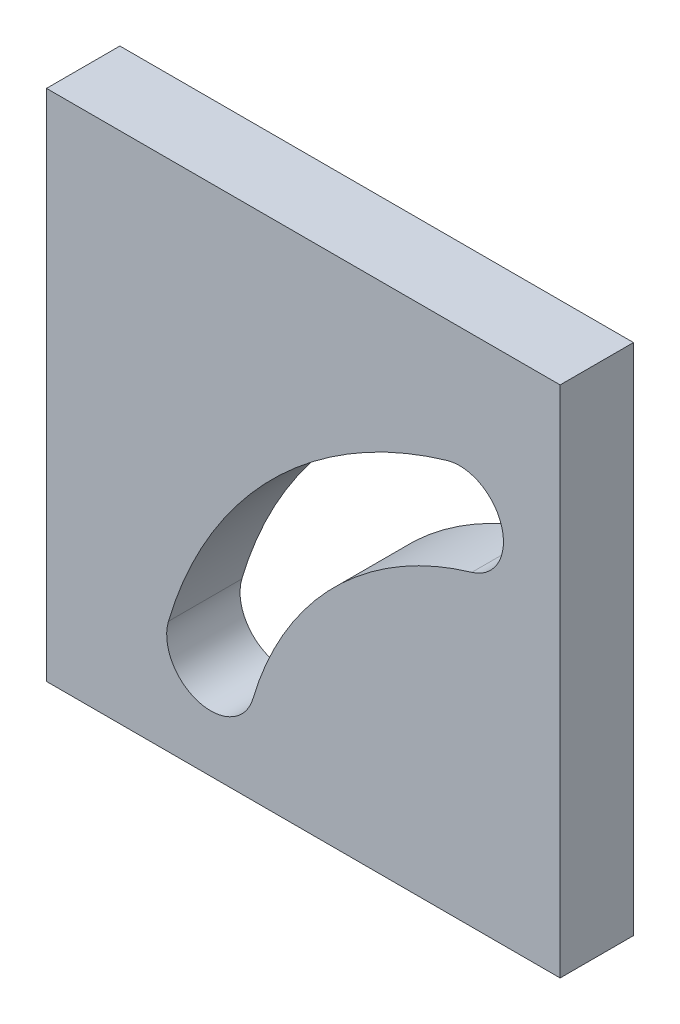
ISO-10303-21;
HEADER;
FILE_DESCRIPTION(('STEP AP214'),'2;1');
FILE_NAME('part.step','',(''),(''),'','','');
FILE_SCHEMA(('AUTOMOTIVE_DESIGN { 1 0 10303 214 1 1 1 1 }'));
ENDSEC;
DATA;
#1=APPLICATION_CONTEXT('core data for automotive mechanical design processes');
#2=APPLICATION_PROTOCOL_DEFINITION('international standard','automotive_design',2000,#1);
#3=PRODUCT_CONTEXT('',#1,'mechanical');
#4=PRODUCT('Part','Part','',(#3));
#5=PRODUCT_RELATED_PRODUCT_CATEGORY('part','',(#4));
#6=PRODUCT_DEFINITION_FORMATION('','',#4);
#7=PRODUCT_DEFINITION_CONTEXT('part definition',#1,'design');
#8=PRODUCT_DEFINITION('design','',#6,#7);
#9=PRODUCT_DEFINITION_SHAPE('','',#8);
#10=(LENGTH_UNIT() NAMED_UNIT(*) SI_UNIT(.MILLI.,.METRE.));
#11=(NAMED_UNIT(*) PLANE_ANGLE_UNIT() SI_UNIT($,.RADIAN.));
#12=(NAMED_UNIT(*) SI_UNIT($,.STERADIAN.) SOLID_ANGLE_UNIT());
#13=UNCERTAINTY_MEASURE_WITH_UNIT(LENGTH_MEASURE(1.E-05),#10,'distance_accuracy_value','');
#14=(GEOMETRIC_REPRESENTATION_CONTEXT(3) GLOBAL_UNCERTAINTY_ASSIGNED_CONTEXT((#13)) GLOBAL_UNIT_ASSIGNED_CONTEXT((#10,
#11,#12)) REPRESENTATION_CONTEXT('',''));
#15=CARTESIAN_POINT('',(0.,0.,0.));
#16=DIRECTION('',(0.,0.,1.));
#17=DIRECTION('',(1.,0.,0.));
#18=AXIS2_PLACEMENT_3D('',#15,#16,#17);
#19=CARTESIAN_POINT('',(0.,0.,10.));
#20=DIRECTION('',(0.,0.,1.));
#21=DIRECTION('',(1.,0.,0.));
#22=AXIS2_PLACEMENT_3D('',#19,#20,#21);
#23=PLANE('',#22);
#24=DIRECTION('',(0.,-1.,0.));
#25=VECTOR('',#24,1.);
#26=CARTESIAN_POINT('',(-35.,-35.,10.));
#27=LINE('',#26,#25);
#28=CARTESIAN_POINT('',(-35.,35.,10.));
#29=VERTEX_POINT('',#28);
#30=CARTESIAN_POINT('',(-35.,-35.,10.));
#31=VERTEX_POINT('',#30);
#32=EDGE_CURVE('E133',#29,#31,#27,.T.);
#33=ORIENTED_EDGE('',*,*,#32,.T.);
#34=DIRECTION('',(1.,0.,0.));
#35=VECTOR('',#34,1.);
#36=CARTESIAN_POINT('',(35.,-35.,10.));
#37=LINE('',#36,#35);
#38=CARTESIAN_POINT('',(35.,-35.,10.));
#39=VERTEX_POINT('',#38);
#40=EDGE_CURVE('E136',#31,#39,#37,.T.);
#41=ORIENTED_EDGE('',*,*,#40,.T.);
#42=DIRECTION('',(0.,1.,0.));
#43=VECTOR('',#42,1.);
#44=CARTESIAN_POINT('',(35.,-35.,10.));
#45=LINE('',#44,#43);
#46=CARTESIAN_POINT('',(35.,35.,10.));
#47=VERTEX_POINT('',#46);
#48=EDGE_CURVE('E139',#39,#47,#45,.T.);
#49=ORIENTED_EDGE('',*,*,#48,.T.);
#50=DIRECTION('',(-1.,0.,0.));
#51=VECTOR('',#50,1.);
#52=CARTESIAN_POINT('',(35.,35.,10.));
#53=LINE('',#52,#51);
#54=EDGE_CURVE('E141',#47,#29,#53,.T.);
#55=ORIENTED_EDGE('',*,*,#54,.T.);
#56=EDGE_LOOP('',(#33,#41,#49,#55));
#57=FACE_BOUND('',#56,.T.);
#58=CARTESIAN_POINT('',(35.3553390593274,-35.3553390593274,10.));
#59=DIRECTION('',(0.,0.,1.));
#60=DIRECTION('',(1.,0.,0.));
#61=AXIS2_PLACEMENT_3D('',#58,#59,#60);
#62=CIRCLE('',#61,56.);
#63=CARTESIAN_POINT('',(19.5891253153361,18.3794402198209,10.));
#64=VERTEX_POINT('',#63);
#65=CARTESIAN_POINT('',(-18.3794402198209,-19.5891253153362,10.));
#66=VERTEX_POINT('',#65);
#67=EDGE_CURVE('E105',#64,#66,#62,.T.);
#68=ORIENTED_EDGE('',*,*,#67,.F.);
#69=CARTESIAN_POINT('',(21.2783625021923,12.6221424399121,10.));
#70=DIRECTION('',(0.,0.,1.));
#71=DIRECTION('',(1.,0.,0.));
#72=AXIS2_PLACEMENT_3D('',#69,#70,#71);
#73=CIRCLE('',#72,6.);
#74=CARTESIAN_POINT('',(22.9675996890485,6.8648446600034,10.));
#75=VERTEX_POINT('',#74);
#76=EDGE_CURVE('E97',#75,#64,#73,.T.);
#77=ORIENTED_EDGE('',*,*,#76,.F.);
#78=CARTESIAN_POINT('',(35.3553390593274,-35.3553390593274,10.));
#79=DIRECTION('',(0.,0.,-1.));
#80=DIRECTION('',(1.,0.,0.));
#81=AXIS2_PLACEMENT_3D('',#78,#79,#80);
#82=CIRCLE('',#81,44.);
#83=CARTESIAN_POINT('',(-6.8648446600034,-22.9675996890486,10.));
#84=VERTEX_POINT('',#83);
#85=EDGE_CURVE('E119',#84,#75,#82,.T.);
#86=ORIENTED_EDGE('',*,*,#85,.F.);
#87=CARTESIAN_POINT('',(-12.6221424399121,-21.2783625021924,10.));
#88=DIRECTION('',(0.,0.,1.));
#89=DIRECTION('',(1.,0.,0.));
#90=AXIS2_PLACEMENT_3D('',#87,#88,#89);
#91=CIRCLE('',#90,6.);
#92=EDGE_CURVE('E117',#66,#84,#91,.T.);
#93=ORIENTED_EDGE('',*,*,#92,.F.);
#94=EDGE_LOOP('',(#68,#77,#86,#93));
#95=FACE_BOUND('',#94,.T.);
#96=ADVANCED_FACE('F32',(#57,#95),#23,.T.);
#97=CARTESIAN_POINT('',(0.,0.,0.));
#98=DIRECTION('',(0.,0.,1.));
#99=DIRECTION('',(1.,0.,0.));
#100=AXIS2_PLACEMENT_3D('',#97,#98,#99);
#101=PLANE('',#100);
#102=DIRECTION('',(0.,-1.,0.));
#103=VECTOR('',#102,1.);
#104=CARTESIAN_POINT('',(-35.,-35.,0.));
#105=LINE('',#104,#103);
#106=CARTESIAN_POINT('',(-35.,35.,0.));
#107=VERTEX_POINT('',#106);
#108=CARTESIAN_POINT('',(-35.,-35.,0.));
#109=VERTEX_POINT('',#108);
#110=EDGE_CURVE('E113',#107,#109,#105,.T.);
#111=ORIENTED_EDGE('',*,*,#110,.F.);
#112=DIRECTION('',(-1.,0.,0.));
#113=VECTOR('',#112,1.);
#114=CARTESIAN_POINT('',(35.,35.,0.));
#115=LINE('',#114,#113);
#116=CARTESIAN_POINT('',(35.,35.,0.));
#117=VERTEX_POINT('',#116);
#118=EDGE_CURVE('E137',#117,#107,#115,.T.);
#119=ORIENTED_EDGE('',*,*,#118,.F.);
#120=DIRECTION('',(0.,1.,0.));
#121=VECTOR('',#120,1.);
#122=CARTESIAN_POINT('',(35.,-35.,0.));
#123=LINE('',#122,#121);
#124=CARTESIAN_POINT('',(35.,-35.,0.));
#125=VERTEX_POINT('',#124);
#126=EDGE_CURVE('E148',#125,#117,#123,.T.);
#127=ORIENTED_EDGE('',*,*,#126,.F.);
#128=DIRECTION('',(1.,0.,0.));
#129=VECTOR('',#128,1.);
#130=CARTESIAN_POINT('',(35.,-35.,0.));
#131=LINE('',#130,#129);
#132=EDGE_CURVE('E146',#109,#125,#131,.T.);
#133=ORIENTED_EDGE('',*,*,#132,.F.);
#134=EDGE_LOOP('',(#111,#119,#127,#133));
#135=FACE_BOUND('',#134,.T.);
#136=CARTESIAN_POINT('',(21.2783625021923,12.6221424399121,0.));
#137=DIRECTION('',(0.,0.,1.));
#138=DIRECTION('',(1.,0.,0.));
#139=AXIS2_PLACEMENT_3D('',#136,#137,#138);
#140=CIRCLE('',#139,6.);
#141=CARTESIAN_POINT('',(22.9675996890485,6.8648446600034,0.));
#142=VERTEX_POINT('',#141);
#143=CARTESIAN_POINT('',(19.5891253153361,18.3794402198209,0.));
#144=VERTEX_POINT('',#143);
#145=EDGE_CURVE('E55',#142,#144,#140,.T.);
#146=ORIENTED_EDGE('',*,*,#145,.T.);
#147=CARTESIAN_POINT('',(35.3553390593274,-35.3553390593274,0.));
#148=DIRECTION('',(0.,0.,1.));
#149=DIRECTION('',(1.,0.,0.));
#150=AXIS2_PLACEMENT_3D('',#147,#148,#149);
#151=CIRCLE('',#150,56.);
#152=CARTESIAN_POINT('',(-18.3794402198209,-19.5891253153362,0.));
#153=VERTEX_POINT('',#152);
#154=EDGE_CURVE('E112',#144,#153,#151,.T.);
#155=ORIENTED_EDGE('',*,*,#154,.T.);
#156=CARTESIAN_POINT('',(-12.6221424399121,-21.2783625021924,0.));
#157=DIRECTION('',(0.,0.,1.));
#158=DIRECTION('',(1.,0.,0.));
#159=AXIS2_PLACEMENT_3D('',#156,#157,#158);
#160=CIRCLE('',#159,6.);
#161=CARTESIAN_POINT('',(-6.8648446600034,-22.9675996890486,0.));
#162=VERTEX_POINT('',#161);
#163=EDGE_CURVE('E125',#153,#162,#160,.T.);
#164=ORIENTED_EDGE('',*,*,#163,.T.);
#165=CARTESIAN_POINT('',(35.3553390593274,-35.3553390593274,0.));
#166=DIRECTION('',(0.,0.,-1.));
#167=DIRECTION('',(1.,0.,0.));
#168=AXIS2_PLACEMENT_3D('',#165,#166,#167);
#169=CIRCLE('',#168,44.);
#170=EDGE_CURVE('E106',#162,#142,#169,.T.);
#171=ORIENTED_EDGE('',*,*,#170,.T.);
#172=EDGE_LOOP('',(#146,#155,#164,#171));
#173=FACE_BOUND('',#172,.T.);
#174=ADVANCED_FACE('F166',(#135,#173),#101,.F.);
#175=CARTESIAN_POINT('',(-35.,-35.,10.));
#176=DIRECTION('',(1.,0.,0.));
#177=DIRECTION('',(0.,0.,-1.));
#178=AXIS2_PLACEMENT_3D('',#175,#176,#177);
#179=PLANE('',#178);
#180=ORIENTED_EDGE('',*,*,#110,.T.);
#181=DIRECTION('',(0.,0.,-1.));
#182=VECTOR('',#181,1.);
#183=CARTESIAN_POINT('',(-35.,-35.,10.));
#184=LINE('',#183,#182);
#185=EDGE_CURVE('E11',#31,#109,#184,.T.);
#186=ORIENTED_EDGE('',*,*,#185,.F.);
#187=ORIENTED_EDGE('',*,*,#32,.F.);
#188=DIRECTION('',(0.,0.,-1.));
#189=VECTOR('',#188,1.);
#190=CARTESIAN_POINT('',(-35.,35.,10.));
#191=LINE('',#190,#189);
#192=EDGE_CURVE('E143',#29,#107,#191,.T.);
#193=ORIENTED_EDGE('',*,*,#192,.T.);
#194=EDGE_LOOP('',(#180,#186,#187,#193));
#195=FACE_BOUND('',#194,.T.);
#196=ADVANCED_FACE('F34',(#195),#179,.F.);
#197=CARTESIAN_POINT('',(35.,-35.,10.));
#198=DIRECTION('',(0.,1.,0.));
#199=DIRECTION('',(0.,0.,1.));
#200=AXIS2_PLACEMENT_3D('',#197,#198,#199);
#201=PLANE('',#200);
#202=ORIENTED_EDGE('',*,*,#132,.T.);
#203=DIRECTION('',(0.,0.,-1.));
#204=VECTOR('',#203,1.);
#205=CARTESIAN_POINT('',(35.,-35.,10.));
#206=LINE('',#205,#204);
#207=EDGE_CURVE('E40',#39,#125,#206,.T.);
#208=ORIENTED_EDGE('',*,*,#207,.F.);
#209=ORIENTED_EDGE('',*,*,#40,.F.);
#210=ORIENTED_EDGE('',*,*,#185,.T.);
#211=EDGE_LOOP('',(#202,#208,#209,#210));
#212=FACE_BOUND('',#211,.T.);
#213=ADVANCED_FACE('F176',(#212),#201,.F.);
#214=CARTESIAN_POINT('',(35.,-35.,10.));
#215=DIRECTION('',(-1.,0.,0.));
#216=DIRECTION('',(0.,0.,1.));
#217=AXIS2_PLACEMENT_3D('',#214,#215,#216);
#218=PLANE('',#217);
#219=ORIENTED_EDGE('',*,*,#126,.T.);
#220=DIRECTION('',(0.,0.,-1.));
#221=VECTOR('',#220,1.);
#222=CARTESIAN_POINT('',(35.,35.,10.));
#223=LINE('',#222,#221);
#224=EDGE_CURVE('E153',#47,#117,#223,.T.);
#225=ORIENTED_EDGE('',*,*,#224,.F.);
#226=ORIENTED_EDGE('',*,*,#48,.F.);
#227=ORIENTED_EDGE('',*,*,#207,.T.);
#228=EDGE_LOOP('',(#219,#225,#226,#227));
#229=FACE_BOUND('',#228,.T.);
#230=ADVANCED_FACE('F160',(#229),#218,.F.);
#231=CARTESIAN_POINT('',(35.,35.,10.));
#232=DIRECTION('',(0.,-1.,0.));
#233=DIRECTION('',(0.,0.,-1.));
#234=AXIS2_PLACEMENT_3D('',#231,#232,#233);
#235=PLANE('',#234);
#236=ORIENTED_EDGE('',*,*,#118,.T.);
#237=ORIENTED_EDGE('',*,*,#192,.F.);
#238=ORIENTED_EDGE('',*,*,#54,.F.);
#239=ORIENTED_EDGE('',*,*,#224,.T.);
#240=EDGE_LOOP('',(#236,#237,#238,#239));
#241=FACE_BOUND('',#240,.T.);
#242=ADVANCED_FACE('F170',(#241),#235,.F.);
#243=CARTESIAN_POINT('',(21.2783625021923,12.6221424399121,10.));
#244=DIRECTION('',(0.,0.,-1.));
#245=DIRECTION('',(-1.,0.,0.));
#246=AXIS2_PLACEMENT_3D('',#243,#244,#245);
#247=CYLINDRICAL_SURFACE('',#246,6.);
#248=ORIENTED_EDGE('',*,*,#145,.F.);
#249=DIRECTION('',(0.,0.,-1.));
#250=VECTOR('',#249,1.);
#251=CARTESIAN_POINT('',(22.9675996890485,6.8648446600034,10.));
#252=LINE('',#251,#250);
#253=EDGE_CURVE('E101',#75,#142,#252,.T.);
#254=ORIENTED_EDGE('',*,*,#253,.F.);
#255=ORIENTED_EDGE('',*,*,#76,.T.);
#256=DIRECTION('',(0.,0.,-1.));
#257=VECTOR('',#256,1.);
#258=CARTESIAN_POINT('',(19.5891253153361,18.3794402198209,10.));
#259=LINE('',#258,#257);
#260=EDGE_CURVE('E100',#64,#144,#259,.T.);
#261=ORIENTED_EDGE('',*,*,#260,.T.);
#262=EDGE_LOOP('',(#248,#254,#255,#261));
#263=FACE_BOUND('',#262,.T.);
#264=ADVANCED_FACE('F99',(#263),#247,.F.);
#265=CARTESIAN_POINT('',(35.3553390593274,-35.3553390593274,10.));
#266=DIRECTION('',(0.,0.,-1.));
#267=DIRECTION('',(-1.,0.,0.));
#268=AXIS2_PLACEMENT_3D('',#265,#266,#267);
#269=CYLINDRICAL_SURFACE('',#268,56.);
#270=ORIENTED_EDGE('',*,*,#154,.F.);
#271=ORIENTED_EDGE('',*,*,#260,.F.);
#272=ORIENTED_EDGE('',*,*,#67,.T.);
#273=DIRECTION('',(0.,0.,-1.));
#274=VECTOR('',#273,1.);
#275=CARTESIAN_POINT('',(-18.3794402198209,-19.5891253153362,10.));
#276=LINE('',#275,#274);
#277=EDGE_CURVE('E114',#66,#153,#276,.T.);
#278=ORIENTED_EDGE('',*,*,#277,.T.);
#279=EDGE_LOOP('',(#270,#271,#272,#278));
#280=FACE_BOUND('',#279,.T.);
#281=ADVANCED_FACE('F109',(#280),#269,.F.);
#282=CARTESIAN_POINT('',(-12.6221424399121,-21.2783625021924,10.));
#283=DIRECTION('',(0.,0.,-1.));
#284=DIRECTION('',(-1.,0.,0.));
#285=AXIS2_PLACEMENT_3D('',#282,#283,#284);
#286=CYLINDRICAL_SURFACE('',#285,6.);
#287=ORIENTED_EDGE('',*,*,#163,.F.);
#288=ORIENTED_EDGE('',*,*,#277,.F.);
#289=ORIENTED_EDGE('',*,*,#92,.T.);
#290=DIRECTION('',(0.,0.,-1.));
#291=VECTOR('',#290,1.);
#292=CARTESIAN_POINT('',(-6.8648446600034,-22.9675996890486,10.));
#293=LINE('',#292,#291);
#294=EDGE_CURVE('E47',#84,#162,#293,.T.);
#295=ORIENTED_EDGE('',*,*,#294,.T.);
#296=EDGE_LOOP('',(#287,#288,#289,#295));
#297=FACE_BOUND('',#296,.T.);
#298=ADVANCED_FACE('F199',(#297),#286,.F.);
#299=CARTESIAN_POINT('',(35.3553390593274,-35.3553390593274,10.));
#300=DIRECTION('',(0.,0.,-1.));
#301=DIRECTION('',(-1.,0.,0.));
#302=AXIS2_PLACEMENT_3D('',#299,#300,#301);
#303=CYLINDRICAL_SURFACE('',#302,44.);
#304=ORIENTED_EDGE('',*,*,#170,.F.);
#305=ORIENTED_EDGE('',*,*,#294,.F.);
#306=ORIENTED_EDGE('',*,*,#85,.T.);
#307=ORIENTED_EDGE('',*,*,#253,.T.);
#308=EDGE_LOOP('',(#304,#305,#306,#307));
#309=FACE_BOUND('',#308,.T.);
#310=ADVANCED_FACE('F203',(#309),#303,.T.);
#311=CLOSED_SHELL('',(#96,#174,#196,#213,#230,#242,#264,#281,#298,#310));
#312=MANIFOLD_SOLID_BREP('B2',#311);
#313=ADVANCED_BREP_SHAPE_REPRESENTATION('',(#18,#312),#14);
#314=SHAPE_DEFINITION_REPRESENTATION(#9,#313);
ENDSEC;
END-ISO-10303-21;
